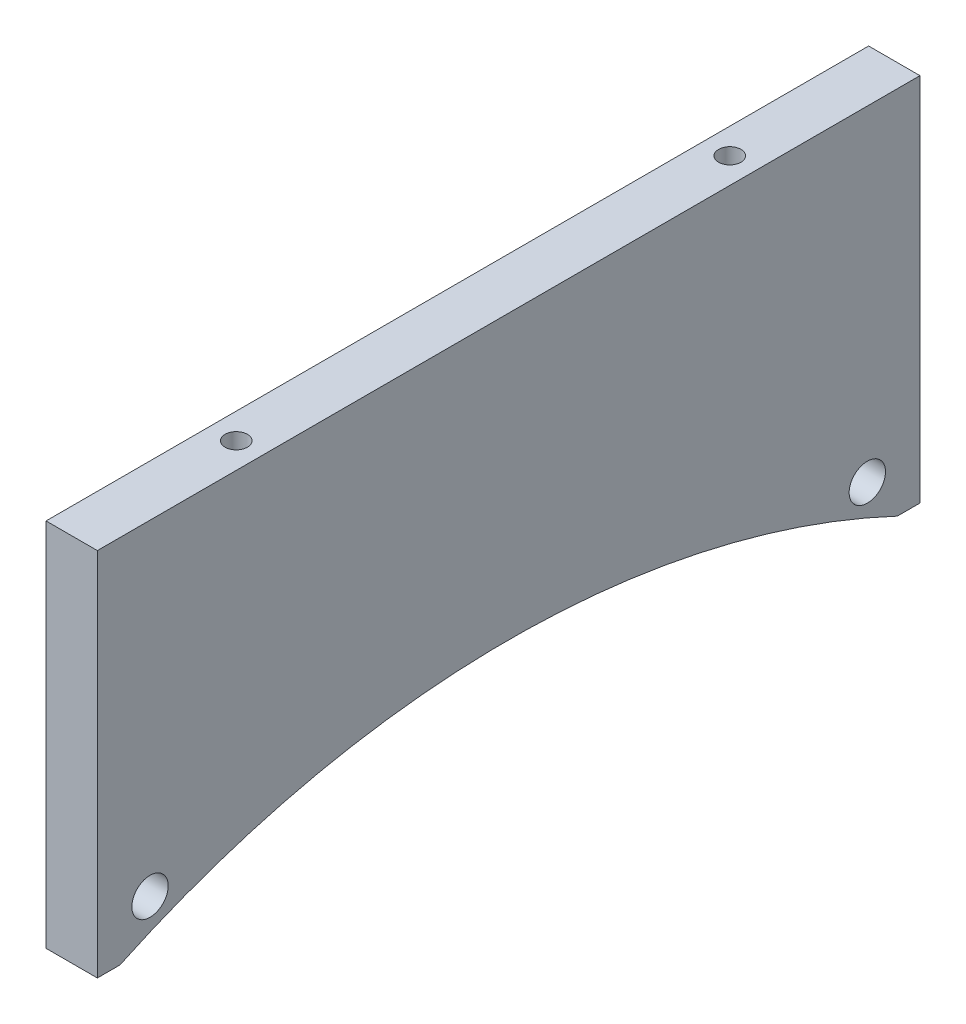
from build123d import *

# Parameters (mm, degrees)
BOSS_EXTRUDE1_DEPTH                          = 7.9248
CSK_FOR_10_FLAT_HEAD_MACHINE_SCREW1_AT_COUNT = 2
CSK_FOR_10_FLAT_HEAD_MACHINE_SCREW1_AT_PITCH = 110.744
LPATTERN1_COUNT                              = 2
LPATTERN1_PITCH                              = 76.2


with BuildPart() as part:
    # Sketch1 → Boss-Extrude1 (new body)
    with BuildSketch(Plane(origin=(0, 0, 0), x_dir=(0, 0, -1), z_dir=(1, 0, 0))):
        with BuildLine():
            Line((-12.573980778, 7.315260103), (-12.573980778, 64.465260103))
            Line((-12.573980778, 64.465260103), (-139.573980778, 64.465260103))
            Line((-139.573980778, 64.465260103), (-139.573980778, 7.315260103))
            Line((-139.573980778, 7.315260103), (-136.078759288, 7.315260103))
            ThreePointArc((-136.078759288, 7.315260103), (-76.073980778, 20.777260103), (-16.069202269, 7.315260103))
            Line((-16.069202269, 7.315260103), (-12.573980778, 7.315260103))
        make_face()
    extrude(amount=BOSS_EXTRUDE1_DEPTH)

    # Sketch2 → CSK for _10 Flat Head Machine Screw1 (revolve, cut)
    with BuildSketch(Plane(origin=(0, 14.173260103, 20.701980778), x_dir=(0, 0, 1), z_dir=(0, 1, 0))):
        Polygon((0, 0), (0, 7.9248), (2.8067, 7.9248), (2.8067, 3.411987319), (4.8895, 1.016), (4.8895, 0), align=None)
    csk_for_10_flat_head_machine_screw1 = revolve(axis=Axis((-6.35, 14.173260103, 20.701980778), (1, 0, 0)), mode=Mode.SUBTRACT)

    # CSK for _10 Flat Head Machine Screw1 at: CSK for _10 Flat Head Machine Screw1 ×2
    with Locations(*[(0, 0, i * CSK_FOR_10_FLAT_HEAD_MACHINE_SCREW1_AT_PITCH) for i in range(1, CSK_FOR_10_FLAT_HEAD_MACHINE_SCREW1_AT_COUNT)]):
        add(csk_for_10_flat_head_machine_screw1, mode=Mode.SUBTRACT)

    # Sketch4 → 8-32 Tapped Hole1 (revolve, cut)
    with BuildSketch(Plane(origin=(3.9624, 64.465260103, 37.973980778), x_dir=(0, 0, 1), z_dir=(1, 0, 0))):
        Polygon((0, 0), (0, 11.197806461), (1.7272, 10.16), (1.7272, 0), align=None)
    f_8_32_tapped_hole1 = revolve(axis=Axis((3.9624, 70.815260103, 37.973980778), (0, -1, 0)), mode=Mode.SUBTRACT)

    # LPattern1: 8-32 Tapped Hole1 ×2
    with Locations(*[(0, 0, i * LPATTERN1_PITCH) for i in range(1, LPATTERN1_COUNT)]):
        add(f_8_32_tapped_hole1, mode=Mode.SUBTRACT)


solid = part.part
